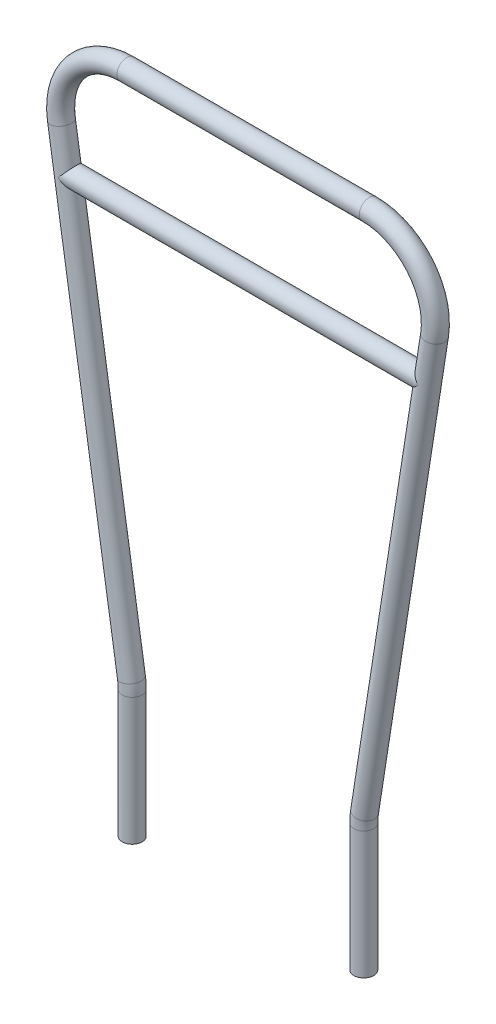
from build123d import *

# Parameters (mm, degrees)
ESQUISSE2_R                  = 15
ESQUISSE2_R_2                = 13
EXTRUSION1_REACH             = 1121.97
ESQUISSE3_R                  = 15
ESQUISSE3_R_2                = 13
EXTRUSION1_DIRECTION_2_REACH = 1121.97


with BuildPart() as part:
    # Balayage2: sweep along a path in Esquisse1
    with BuildLine(Plane.XY) as balayage2_path:
        Line((0, 0), (0, 192.234610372))
        ThreePointArc((0, 192.234610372), (-0.300149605, 199.976692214), (-1.198796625, 207.672298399))
        Line((-1.198796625, 207.672298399), (-106.962861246, 884.562311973))
        ThreePointArc((-106.962861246, 884.562311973), (-84.134576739, 965.023961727), (-8.161657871, 1000))
        Line((-8.161657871, 1000), (358.161657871, 1000))
        ThreePointArc((358.161657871, 1000), (434.134576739, 965.023961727), (456.962861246, 884.562311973))
        Line((456.962861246, 884.562311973), (351.198796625, 207.672298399))
        ThreePointArc((351.198796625, 207.672298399), (350.300149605, 199.976692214), (350, 192.234610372))
        Line((350, 192.234610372), (350, 0))
    # Esquisse2 → Balayage2 (sweep)
    with BuildSketch(Plane(origin=(0, 0, 0), x_dir=(1, 0, 0), z_dir=(0, 1, 0))):
        Circle(ESQUISSE2_R)
        Circle(ESQUISSE2_R_2, mode=Mode.SUBTRACT)
    sweep(path=balayage2_path.line)

    # Esquisse3 → Extrusion1 (add, up to next)
    with BuildSketch(Plane(origin=(0, 0, 0), x_dir=(0, 0, -1), z_dir=(1, 0, 0)), mode=Mode.PRIVATE) as extrusion1_sk1:
        with Locations((0, 820.837125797)):
            Circle(ESQUISSE3_R)
        with Locations((0, 820.837125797)):
            Circle(ESQUISSE3_R_2, mode=Mode.SUBTRACT)
    extrusion1_tool1 = extrude(extrusion1_sk1.sketch, amount=EXTRUSION1_REACH, mode=Mode.PRIVATE) - part.part
    add(extrusion1_tool1.solids().sort_by_distance((0, 820.837126, 14.575736))[0])

    # Esquisse3 → Extrusion1 direction 2 (add, up to next)
    with BuildSketch(Plane(origin=(0, 0, 0), x_dir=(0, 0, -1), z_dir=(1, 0, 0)), mode=Mode.PRIVATE) as extrusion1_direction_2_sk1:
        with Locations((0, 820.837125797)):
            Circle(ESQUISSE3_R)
        with Locations((0, 820.837125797)):
            Circle(ESQUISSE3_R_2, mode=Mode.SUBTRACT)
    extrusion1_direction_2_tool1 = extrude(extrusion1_direction_2_sk1.sketch, amount=-EXTRUSION1_DIRECTION_2_REACH, mode=Mode.PRIVATE) - part.part
    add(extrusion1_direction_2_tool1.solids().sort_by_distance((0, 820.837126, 14.575736))[0])


solid = part.part
